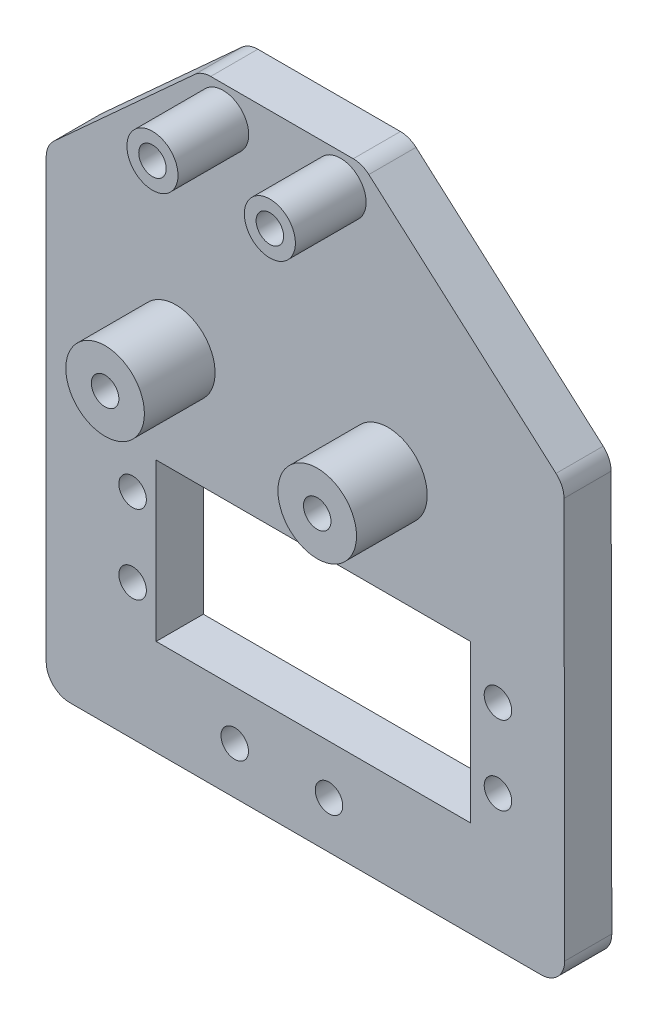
from build123d import *

# Parameters (mm, degrees)
SKETCH_1_R          = 1.75
EXTRUDE_1_DEPTH     = 3
SKETCH_5_R          = 1.75
SKETCH_5_W          = 40
SKETCH_5_H          = 20
CUT_EXTRUDE_2_DEPTH = 87.116200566
SKETCH_6_R          = 5
EXTRUDE_2_DEPTH     = 9
SKETCH_11_R         = 1.75
CUT_EXTRUDE_3_DEPTH = 88.206651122
SKETCH_12_R         = 3.25
EXTRUDE_3_DEPTH     = 9
SKETCH_13_R         = 1.75
CUT_EXTRUDE_4_DEPTH = 88.206651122
FILLET_1_R          = 3


with BuildPart() as part:
    # Sketch 1 → Extrude 1 (new, symmetric)
    with BuildSketch(Plane.XY):
        Polygon((0, 0), (-30, 0), (-30, 30), (-30, 60), (-10.220537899, 78), (10.220537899, 78), (35.906976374, 55.32380657), (36, 0), (30, 0), align=None)
        with Locations((-7.470537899, 74)):
            Circle(SKETCH_1_R, mode=Mode.SUBTRACT)
        with Locations((-6, 6)):
            Circle(SKETCH_1_R, mode=Mode.SUBTRACT)
        with Locations((-13.5, 45.605)):
            Circle(SKETCH_1_R, mode=Mode.SUBTRACT)
        with Locations(Location((6, 6, 0), (0, 0, 180))):
            Circle(SKETCH_1_R, mode=Mode.SUBTRACT)
        with Locations(Location((13.5, 45.605, 0), (0, 0, 180))):
            Circle(SKETCH_1_R, mode=Mode.SUBTRACT)
        with Locations(Location((7.470537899, 74, 0), (0, 0, 180))):
            Circle(SKETCH_1_R, mode=Mode.SUBTRACT)
    extrude(amount=EXTRUDE_1_DEPTH, both=True)

    # Sketch 5 → Cut-Extrude 2 (cut, through all)
    with BuildSketch(Plane.XY.offset(3)):
        with Locations((27.5, 27.25)):
            Circle(SKETCH_5_R)
        with Locations(Location((-19, 27.25, 0), (0, 0, 180))):
            Circle(SKETCH_5_R)
        with Locations(Location((27.5, 17.25, 0), (0, 0, 180))):
            Circle(SKETCH_5_R)
        with Locations((-19, 17.25)):
            Circle(SKETCH_5_R)
        with Locations((4, 22.25)):
            Rectangle(SKETCH_5_W, SKETCH_5_H)
    extrude(amount=-CUT_EXTRUDE_2_DEPTH, mode=Mode.SUBTRACT)

    # Sketch 6 → Extrude 2 (add)
    with BuildSketch(Plane.XY.offset(3)):
        with Locations(Location((-13.5, 45.605, 0), (0, 0, 180))):
            Circle(SKETCH_6_R)
        with Locations(Location((13.5, 45.605, 0), (0, 0, 180))):
            Circle(SKETCH_6_R)
    extrude(amount=EXTRUDE_2_DEPTH)

    # Sketch 11 → Cut-Extrude 3 (cut, through all)
    with BuildSketch(Plane.XY.offset(12)):
        with Locations((-13.5, 45.605)):
            Circle(SKETCH_11_R)
        with Locations(Location((13.5, 45.605, 0), (0, 0, 180))):
            Circle(SKETCH_11_R)
    extrude(amount=-CUT_EXTRUDE_3_DEPTH, mode=Mode.SUBTRACT)

    # Sketch 12 → Extrude 3 (add)
    with BuildSketch(Plane.XY.offset(3)):
        with Locations(Location((-7.470537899, 74, 0), (0, 0, 180))):
            Circle(SKETCH_12_R)
        with Locations(Location((7.470537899, 74, 0), (0, 0, 180))):
            Circle(SKETCH_12_R)
    extrude(amount=EXTRUDE_3_DEPTH)

    # Sketch 13 → Cut-Extrude 4 (cut, through all)
    with BuildSketch(Plane(origin=(0, 0, -3), x_dir=(-1, 0, 0), z_dir=(0, 0, -1))):
        with Locations((-7.470537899, 74)):
            Circle(SKETCH_13_R)
        with Locations((7.470537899, 74)):
            Circle(SKETCH_13_R)
    extrude(amount=-CUT_EXTRUDE_4_DEPTH, mode=Mode.SUBTRACT)

    # Fillet 1
    fillet_1_edges = [part.edges().sort_by_distance(p)[0] for p in [
        (-30, 0, 0),
        (-30, 60, 0),
        (-10.220537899, 78, 0),
        (10.220537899, 78, 0),
        (35.906976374, 55.32380657, 0),
        (36, 0, 0),
    ]]
    fillet(fillet_1_edges, radius=FILLET_1_R)


solid = part.part
